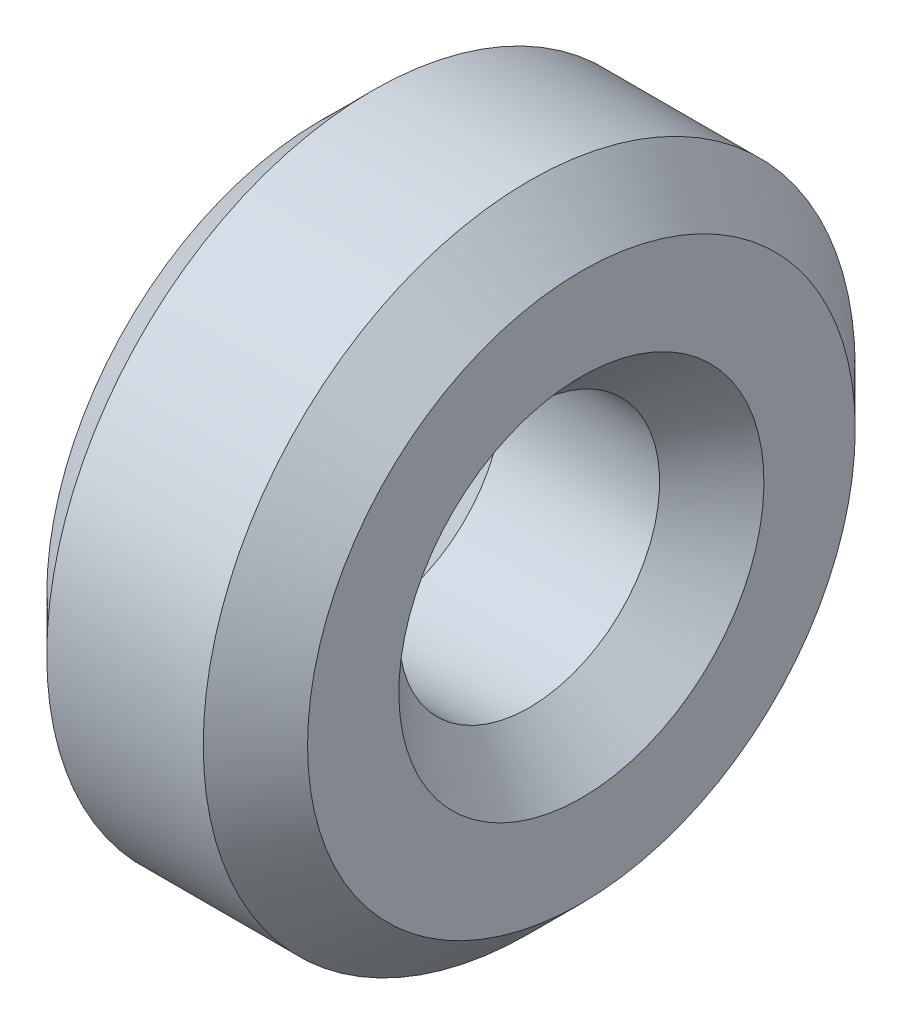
ISO-10303-21;
HEADER;
FILE_DESCRIPTION(('STEP AP214'),'2;1');
FILE_NAME('part.step','',(''),(''),'','','');
FILE_SCHEMA(('AUTOMOTIVE_DESIGN { 1 0 10303 214 1 1 1 1 }'));
ENDSEC;
DATA;
#1=APPLICATION_CONTEXT('core data for automotive mechanical design processes');
#2=APPLICATION_PROTOCOL_DEFINITION('international standard','automotive_design',2000,#1);
#3=PRODUCT_CONTEXT('',#1,'mechanical');
#4=PRODUCT('Part','Part','',(#3));
#5=PRODUCT_RELATED_PRODUCT_CATEGORY('part','',(#4));
#6=PRODUCT_DEFINITION_FORMATION('','',#4);
#7=PRODUCT_DEFINITION_CONTEXT('part definition',#1,'design');
#8=PRODUCT_DEFINITION('design','',#6,#7);
#9=PRODUCT_DEFINITION_SHAPE('','',#8);
#10=(LENGTH_UNIT() NAMED_UNIT(*) SI_UNIT(.MILLI.,.METRE.));
#11=(NAMED_UNIT(*) PLANE_ANGLE_UNIT() SI_UNIT($,.RADIAN.));
#12=(NAMED_UNIT(*) SI_UNIT($,.STERADIAN.) SOLID_ANGLE_UNIT());
#13=UNCERTAINTY_MEASURE_WITH_UNIT(LENGTH_MEASURE(1.E-05),#10,'distance_accuracy_value','');
#14=(GEOMETRIC_REPRESENTATION_CONTEXT(3) GLOBAL_UNCERTAINTY_ASSIGNED_CONTEXT((#13)) GLOBAL_UNIT_ASSIGNED_CONTEXT((#10,
#11,#12)) REPRESENTATION_CONTEXT('',''));
#15=CARTESIAN_POINT('',(0.,0.,0.));
#16=DIRECTION('',(0.,0.,1.));
#17=DIRECTION('',(1.,0.,0.));
#18=AXIS2_PLACEMENT_3D('',#15,#16,#17);
#19=CARTESIAN_POINT('',(0.,-1.75,0.));
#20=DIRECTION('',(-1.,0.,0.));
#21=DIRECTION('',(0.,1.,0.));
#22=AXIS2_PLACEMENT_3D('',#19,#20,#21);
#23=PLANE('',#22);
#24=CARTESIAN_POINT('',(0.,0.,0.));
#25=DIRECTION('',(1.,0.,0.));
#26=DIRECTION('',(0.,-1.,0.));
#27=AXIS2_PLACEMENT_3D('',#24,#25,#26);
#28=CIRCLE('',#27,1.4);
#29=CARTESIAN_POINT('',(0.,-1.4,0.));
#30=VERTEX_POINT('',#29);
#31=EDGE_CURVE('E9',#30,#30,#28,.T.);
#32=ORIENTED_EDGE('',*,*,#31,.T.);
#33=EDGE_LOOP('',(#32));
#34=FACE_BOUND('',#33,.T.);
#35=CARTESIAN_POINT('',(0.,0.,0.));
#36=DIRECTION('',(1.,0.,0.));
#37=DIRECTION('',(0.,-1.,0.));
#38=AXIS2_PLACEMENT_3D('',#35,#36,#37);
#39=CIRCLE('',#38,2.1);
#40=CARTESIAN_POINT('',(0.,-2.1,0.));
#41=VERTEX_POINT('',#40);
#42=EDGE_CURVE('E53',#41,#41,#39,.T.);
#43=ORIENTED_EDGE('',*,*,#42,.F.);
#44=EDGE_LOOP('',(#43));
#45=FACE_BOUND('',#44,.T.);
#46=ADVANCED_FACE('F15',(#34,#45),#23,.T.);
#47=CARTESIAN_POINT('',(0.2,0.,0.));
#48=DIRECTION('',(-1.,0.,0.));
#49=DIRECTION('',(0.,-1.,0.));
#50=AXIS2_PLACEMENT_3D('',#47,#48,#49);
#51=CONICAL_SURFACE('',#50,1.2,0.785398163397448);
#52=CARTESIAN_POINT('',(0.4,0.,0.));
#53=DIRECTION('',(1.,0.,0.));
#54=DIRECTION('',(0.,-1.,0.));
#55=AXIS2_PLACEMENT_3D('',#52,#53,#54);
#56=CIRCLE('',#55,1.);
#57=CARTESIAN_POINT('',(0.4,-1.,0.));
#58=VERTEX_POINT('',#57);
#59=EDGE_CURVE('E22',#58,#58,#56,.T.);
#60=ORIENTED_EDGE('',*,*,#59,.T.);
#61=EDGE_LOOP('',(#60));
#62=FACE_BOUND('',#61,.T.);
#63=ORIENTED_EDGE('',*,*,#31,.F.);
#64=EDGE_LOOP('',(#63));
#65=FACE_BOUND('',#64,.T.);
#66=ADVANCED_FACE('F82',(#62,#65),#51,.F.);
#67=CARTESIAN_POINT('',(1.,0.,0.));
#68=DIRECTION('',(-1.,0.,0.));
#69=DIRECTION('',(0.,-1.,0.));
#70=AXIS2_PLACEMENT_3D('',#67,#68,#69);
#71=CYLINDRICAL_SURFACE('',#70,1.);
#72=CARTESIAN_POINT('',(1.6,0.,0.));
#73=DIRECTION('',(1.,0.,0.));
#74=DIRECTION('',(0.,-1.,0.));
#75=AXIS2_PLACEMENT_3D('',#72,#73,#74);
#76=CIRCLE('',#75,1.);
#77=CARTESIAN_POINT('',(1.6,-1.,0.));
#78=VERTEX_POINT('',#77);
#79=EDGE_CURVE('E58',#78,#78,#76,.T.);
#80=ORIENTED_EDGE('',*,*,#79,.T.);
#81=EDGE_LOOP('',(#80));
#82=FACE_BOUND('',#81,.T.);
#83=ORIENTED_EDGE('',*,*,#59,.F.);
#84=EDGE_LOOP('',(#83));
#85=FACE_BOUND('',#84,.T.);
#86=ADVANCED_FACE('F66',(#82,#85),#71,.F.);
#87=CARTESIAN_POINT('',(1.8,0.,0.));
#88=DIRECTION('',(1.,0.,0.));
#89=DIRECTION('',(0.,-1.,0.));
#90=AXIS2_PLACEMENT_3D('',#87,#88,#89);
#91=CONICAL_SURFACE('',#90,1.2,0.78539816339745);
#92=CARTESIAN_POINT('',(2.,0.,0.));
#93=DIRECTION('',(1.,0.,0.));
#94=DIRECTION('',(0.,-1.,0.));
#95=AXIS2_PLACEMENT_3D('',#92,#93,#94);
#96=CIRCLE('',#95,1.4);
#97=CARTESIAN_POINT('',(2.,-1.4,0.));
#98=VERTEX_POINT('',#97);
#99=EDGE_CURVE('E63',#98,#98,#96,.T.);
#100=ORIENTED_EDGE('',*,*,#99,.T.);
#101=EDGE_LOOP('',(#100));
#102=FACE_BOUND('',#101,.T.);
#103=ORIENTED_EDGE('',*,*,#79,.F.);
#104=EDGE_LOOP('',(#103));
#105=FACE_BOUND('',#104,.T.);
#106=ADVANCED_FACE('F69',(#102,#105),#91,.F.);
#107=CARTESIAN_POINT('',(2.,-1.75,0.));
#108=DIRECTION('',(1.,0.,0.));
#109=DIRECTION('',(0.,-1.,0.));
#110=AXIS2_PLACEMENT_3D('',#107,#108,#109);
#111=PLANE('',#110);
#112=CARTESIAN_POINT('',(2.,0.,0.));
#113=DIRECTION('',(1.,0.,0.));
#114=DIRECTION('',(0.,-1.,0.));
#115=AXIS2_PLACEMENT_3D('',#112,#113,#114);
#116=CIRCLE('',#115,2.1);
#117=CARTESIAN_POINT('',(2.,-2.1,0.));
#118=VERTEX_POINT('',#117);
#119=EDGE_CURVE('E61',#118,#118,#116,.T.);
#120=ORIENTED_EDGE('',*,*,#119,.T.);
#121=EDGE_LOOP('',(#120));
#122=FACE_BOUND('',#121,.T.);
#123=ORIENTED_EDGE('',*,*,#99,.F.);
#124=EDGE_LOOP('',(#123));
#125=FACE_BOUND('',#124,.T.);
#126=ADVANCED_FACE('F71',(#122,#125),#111,.T.);
#127=CARTESIAN_POINT('',(1.8,0.,0.));
#128=DIRECTION('',(-1.,0.,0.));
#129=DIRECTION('',(0.,-1.,0.));
#130=AXIS2_PLACEMENT_3D('',#127,#128,#129);
#131=CONICAL_SURFACE('',#130,2.3,0.785398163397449);
#132=CARTESIAN_POINT('',(1.6,0.,0.));
#133=DIRECTION('',(1.,0.,0.));
#134=DIRECTION('',(0.,-1.,0.));
#135=AXIS2_PLACEMENT_3D('',#132,#133,#134);
#136=CIRCLE('',#135,2.5);
#137=CARTESIAN_POINT('',(1.6,-2.5,0.));
#138=VERTEX_POINT('',#137);
#139=EDGE_CURVE('E55',#138,#138,#136,.T.);
#140=ORIENTED_EDGE('',*,*,#139,.T.);
#141=EDGE_LOOP('',(#140));
#142=FACE_BOUND('',#141,.T.);
#143=ORIENTED_EDGE('',*,*,#119,.F.);
#144=EDGE_LOOP('',(#143));
#145=FACE_BOUND('',#144,.T.);
#146=ADVANCED_FACE('F79',(#142,#145),#131,.T.);
#147=CARTESIAN_POINT('',(1.,0.,0.));
#148=DIRECTION('',(-1.,0.,0.));
#149=DIRECTION('',(0.,-1.,0.));
#150=AXIS2_PLACEMENT_3D('',#147,#148,#149);
#151=CYLINDRICAL_SURFACE('',#150,2.5);
#152=CARTESIAN_POINT('',(0.4,0.,0.));
#153=DIRECTION('',(1.,0.,0.));
#154=DIRECTION('',(0.,-1.,0.));
#155=AXIS2_PLACEMENT_3D('',#152,#153,#154);
#156=CIRCLE('',#155,2.5);
#157=CARTESIAN_POINT('',(0.4,-2.5,0.));
#158=VERTEX_POINT('',#157);
#159=EDGE_CURVE('E49',#158,#158,#156,.T.);
#160=ORIENTED_EDGE('',*,*,#159,.T.);
#161=EDGE_LOOP('',(#160));
#162=FACE_BOUND('',#161,.T.);
#163=ORIENTED_EDGE('',*,*,#139,.F.);
#164=EDGE_LOOP('',(#163));
#165=FACE_BOUND('',#164,.T.);
#166=ADVANCED_FACE('F50',(#162,#165),#151,.T.);
#167=CARTESIAN_POINT('',(0.2,0.,0.));
#168=DIRECTION('',(1.,0.,0.));
#169=DIRECTION('',(0.,-1.,0.));
#170=AXIS2_PLACEMENT_3D('',#167,#168,#169);
#171=CONICAL_SURFACE('',#170,2.3,0.785398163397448);
#172=ORIENTED_EDGE('',*,*,#42,.T.);
#173=EDGE_LOOP('',(#172));
#174=FACE_BOUND('',#173,.T.);
#175=ORIENTED_EDGE('',*,*,#159,.F.);
#176=EDGE_LOOP('',(#175));
#177=FACE_BOUND('',#176,.T.);
#178=ADVANCED_FACE('F92',(#174,#177),#171,.T.);
#179=CLOSED_SHELL('',(#46,#66,#86,#106,#126,#146,#166,#178));
#180=MANIFOLD_SOLID_BREP('B1',#179);
#181=ADVANCED_BREP_SHAPE_REPRESENTATION('',(#18,#180),#14);
#182=SHAPE_DEFINITION_REPRESENTATION(#9,#181);
ENDSEC;
END-ISO-10303-21;
